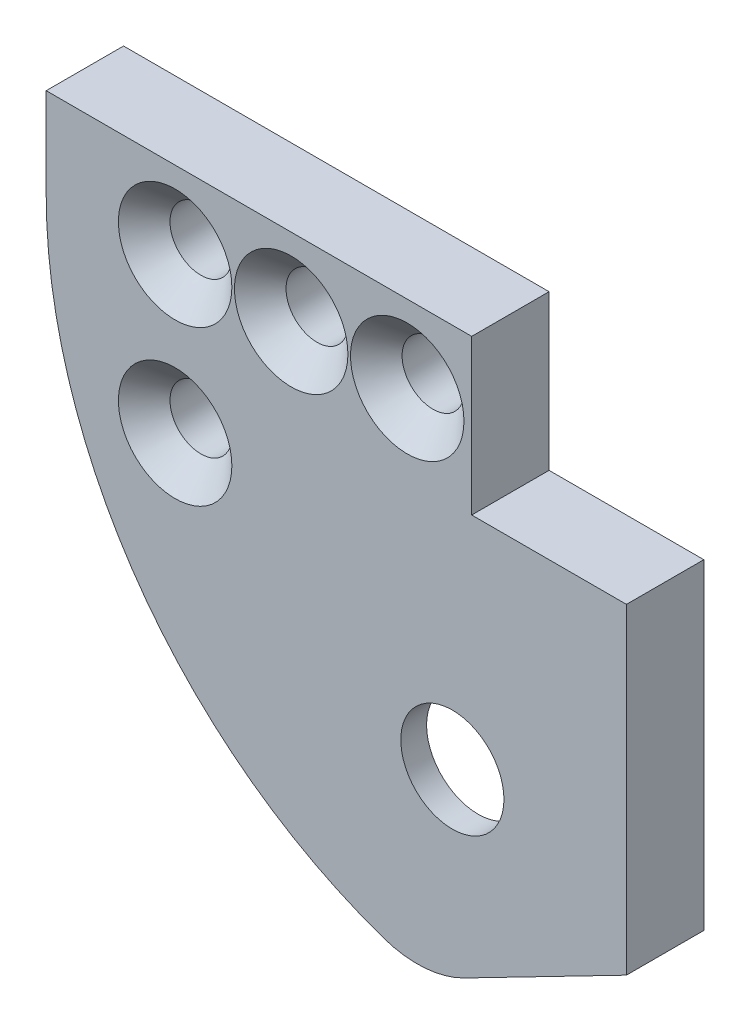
ISO-10303-21;
HEADER;
FILE_DESCRIPTION(('STEP AP214'),'2;1');
FILE_NAME('part.step','',(''),(''),'','','');
FILE_SCHEMA(('AUTOMOTIVE_DESIGN { 1 0 10303 214 1 1 1 1 }'));
ENDSEC;
DATA;
#1=APPLICATION_CONTEXT('core data for automotive mechanical design processes');
#2=APPLICATION_PROTOCOL_DEFINITION('international standard','automotive_design',2000,#1);
#3=PRODUCT_CONTEXT('',#1,'mechanical');
#4=PRODUCT('Part','Part','',(#3));
#5=PRODUCT_RELATED_PRODUCT_CATEGORY('part','',(#4));
#6=PRODUCT_DEFINITION_FORMATION('','',#4);
#7=PRODUCT_DEFINITION_CONTEXT('part definition',#1,'design');
#8=PRODUCT_DEFINITION('design','',#6,#7);
#9=PRODUCT_DEFINITION_SHAPE('','',#8);
#10=(LENGTH_UNIT() NAMED_UNIT(*) SI_UNIT(.MILLI.,.METRE.));
#11=(NAMED_UNIT(*) PLANE_ANGLE_UNIT() SI_UNIT($,.RADIAN.));
#12=(NAMED_UNIT(*) SI_UNIT($,.STERADIAN.) SOLID_ANGLE_UNIT());
#13=UNCERTAINTY_MEASURE_WITH_UNIT(LENGTH_MEASURE(1.E-05),#10,'distance_accuracy_value','');
#14=(GEOMETRIC_REPRESENTATION_CONTEXT(3) GLOBAL_UNCERTAINTY_ASSIGNED_CONTEXT((#13)) GLOBAL_UNIT_ASSIGNED_CONTEXT((#10,
#11,#12)) REPRESENTATION_CONTEXT('',''));
#15=CARTESIAN_POINT('',(0.,0.,0.));
#16=DIRECTION('',(0.,0.,1.));
#17=DIRECTION('',(1.,0.,0.));
#18=AXIS2_PLACEMENT_3D('',#15,#16,#17);
#19=CARTESIAN_POINT('',(31.25,56.0757599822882,10.999));
#20=DIRECTION('',(0.,0.,1.));
#21=DIRECTION('',(1.,0.,0.));
#22=AXIS2_PLACEMENT_3D('',#19,#20,#21);
#23=CYLINDRICAL_SURFACE('',#22,2.);
#24=CARTESIAN_POINT('',(31.25,56.0757599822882,14.));
#25=DIRECTION('',(0.,0.,1.));
#26=DIRECTION('',(1.,0.,0.));
#27=AXIS2_PLACEMENT_3D('',#24,#25,#26);
#28=CIRCLE('',#27,2.);
#29=CARTESIAN_POINT('',(33.25,56.0757599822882,14.));
#30=VERTEX_POINT('',#29);
#31=EDGE_CURVE('E132',#30,#30,#28,.T.);
#32=ORIENTED_EDGE('',*,*,#31,.T.);
#33=EDGE_LOOP('',(#32));
#34=FACE_BOUND('',#33,.T.);
#35=CARTESIAN_POINT('',(31.25,56.0757599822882,13.));
#36=DIRECTION('',(0.,0.,-1.));
#37=DIRECTION('',(-1.,0.,0.));
#38=AXIS2_PLACEMENT_3D('',#35,#36,#37);
#39=CIRCLE('',#38,2.);
#40=CARTESIAN_POINT('',(29.25,56.0757599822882,13.));
#41=VERTEX_POINT('',#40);
#42=EDGE_CURVE('E130',#41,#41,#39,.F.);
#43=ORIENTED_EDGE('',*,*,#42,.F.);
#44=EDGE_LOOP('',(#43));
#45=FACE_BOUND('',#44,.T.);
#46=ADVANCED_FACE('F33',(#34,#45),#23,.F.);
#47=CARTESIAN_POINT('',(15.5,71.,14.));
#48=DIRECTION('',(0.,-1.,0.));
#49=DIRECTION('',(0.,0.,-1.));
#50=AXIS2_PLACEMENT_3D('',#47,#48,#49);
#51=PLANE('',#50);
#52=DIRECTION('',(-1.,0.,0.));
#53=VECTOR('',#52,1.);
#54=CARTESIAN_POINT('',(15.5,71.,11.));
#55=LINE('',#54,#53);
#56=CARTESIAN_POINT('',(32.,71.,11.));
#57=VERTEX_POINT('',#56);
#58=CARTESIAN_POINT('',(15.5,71.,11.));
#59=VERTEX_POINT('',#58);
#60=EDGE_CURVE('E121',#57,#59,#55,.T.);
#61=ORIENTED_EDGE('',*,*,#60,.T.);
#62=DIRECTION('',(0.,0.,-1.));
#63=VECTOR('',#62,1.);
#64=CARTESIAN_POINT('',(15.5,71.,14.));
#65=LINE('',#64,#63);
#66=CARTESIAN_POINT('',(15.5,71.,14.));
#67=VERTEX_POINT('',#66);
#68=EDGE_CURVE('E102',#67,#59,#65,.T.);
#69=ORIENTED_EDGE('',*,*,#68,.F.);
#70=DIRECTION('',(-1.,0.,0.));
#71=VECTOR('',#70,1.);
#72=CARTESIAN_POINT('',(15.5,71.,14.));
#73=LINE('',#72,#71);
#74=CARTESIAN_POINT('',(32.,71.,14.));
#75=VERTEX_POINT('',#74);
#76=EDGE_CURVE('E108',#75,#67,#73,.T.);
#77=ORIENTED_EDGE('',*,*,#76,.F.);
#78=DIRECTION('',(0.,0.,-1.));
#79=VECTOR('',#78,1.);
#80=CARTESIAN_POINT('',(32.,71.,14.));
#81=LINE('',#80,#79);
#82=EDGE_CURVE('E191',#75,#57,#81,.T.);
#83=ORIENTED_EDGE('',*,*,#82,.T.);
#84=EDGE_LOOP('',(#61,#69,#77,#83));
#85=FACE_BOUND('',#84,.T.);
#86=ADVANCED_FACE('F119',(#85),#51,.F.);
#87=CARTESIAN_POINT('',(15.5,67.5,14.));
#88=DIRECTION('',(1.,0.,0.));
#89=DIRECTION('',(0.,0.,-1.));
#90=AXIS2_PLACEMENT_3D('',#87,#88,#89);
#91=PLANE('',#90);
#92=DIRECTION('',(0.,-1.,0.));
#93=VECTOR('',#92,1.);
#94=CARTESIAN_POINT('',(15.5,67.5,11.));
#95=LINE('',#94,#93);
#96=CARTESIAN_POINT('',(15.5,67.5,11.));
#97=VERTEX_POINT('',#96);
#98=EDGE_CURVE('E193',#59,#97,#95,.T.);
#99=ORIENTED_EDGE('',*,*,#98,.T.);
#100=DIRECTION('',(0.,0.,-1.));
#101=VECTOR('',#100,1.);
#102=CARTESIAN_POINT('',(15.5,67.5,14.));
#103=LINE('',#102,#101);
#104=CARTESIAN_POINT('',(15.5,67.5,14.));
#105=VERTEX_POINT('',#104);
#106=EDGE_CURVE('E105',#105,#97,#103,.T.);
#107=ORIENTED_EDGE('',*,*,#106,.F.);
#108=DIRECTION('',(0.,-1.,0.));
#109=VECTOR('',#108,1.);
#110=CARTESIAN_POINT('',(15.5,67.5,14.));
#111=LINE('',#110,#109);
#112=EDGE_CURVE('E98',#67,#105,#111,.T.);
#113=ORIENTED_EDGE('',*,*,#112,.F.);
#114=ORIENTED_EDGE('',*,*,#68,.T.);
#115=EDGE_LOOP('',(#99,#107,#113,#114));
#116=FACE_BOUND('',#115,.T.);
#117=ADVANCED_FACE('F100',(#116),#91,.F.);
#118=CARTESIAN_POINT('',(35.,67.5,14.));
#119=DIRECTION('',(0.,0.,-1.));
#120=DIRECTION('',(-1.,0.,0.));
#121=AXIS2_PLACEMENT_3D('',#118,#119,#120);
#122=CYLINDRICAL_SURFACE('',#121,19.5);
#123=CARTESIAN_POINT('',(35.,67.5,11.));
#124=DIRECTION('',(0.,0.,1.));
#125=DIRECTION('',(1.,0.,0.));
#126=AXIS2_PLACEMENT_3D('',#123,#124,#125);
#127=CIRCLE('',#126,19.5);
#128=CARTESIAN_POINT('',(28.56738090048,49.0915396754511,11.));
#129=VERTEX_POINT('',#128);
#130=EDGE_CURVE('E195',#97,#129,#127,.T.);
#131=ORIENTED_EDGE('',*,*,#130,.T.);
#132=DIRECTION('',(0.,0.,-1.));
#133=VECTOR('',#132,1.);
#134=CARTESIAN_POINT('',(28.56738090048,49.0915396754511,14.));
#135=LINE('',#134,#133);
#136=CARTESIAN_POINT('',(28.56738090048,49.0915396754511,14.));
#137=VERTEX_POINT('',#136);
#138=EDGE_CURVE('E41',#129,#137,#135,.F.);
#139=ORIENTED_EDGE('',*,*,#138,.T.);
#140=CARTESIAN_POINT('',(35.,67.5,14.));
#141=DIRECTION('',(0.,0.,1.));
#142=DIRECTION('',(1.,0.,0.));
#143=AXIS2_PLACEMENT_3D('',#140,#141,#142);
#144=CIRCLE('',#143,19.5);
#145=EDGE_CURVE('E107',#105,#137,#144,.T.);
#146=ORIENTED_EDGE('',*,*,#145,.F.);
#147=ORIENTED_EDGE('',*,*,#106,.T.);
#148=EDGE_LOOP('',(#131,#139,#146,#147));
#149=FACE_BOUND('',#148,.T.);
#150=ADVANCED_FACE('F228',(#149),#122,.T.);
#151=CARTESIAN_POINT('',(38.,52.5477504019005,14.));
#152=DIRECTION('',(-0.45797929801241,0.888962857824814,0.));
#153=DIRECTION('',(-0.888962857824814,-0.45797929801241,0.));
#154=AXIS2_PLACEMENT_3D('',#151,#152,#153);
#155=PLANE('',#154);
#156=DIRECTION('',(0.888962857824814,0.45797929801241,0.));
#157=VECTOR('',#156,1.);
#158=CARTESIAN_POINT('',(38.,52.5477504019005,14.));
#159=LINE('',#158,#157);
#160=CARTESIAN_POINT('',(31.7188097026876,49.3117826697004,14.));
#161=VERTEX_POINT('',#160);
#162=CARTESIAN_POINT('',(38.,52.5477504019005,14.));
#163=VERTEX_POINT('',#162);
#164=EDGE_CURVE('E184',#161,#163,#159,.T.);
#165=ORIENTED_EDGE('',*,*,#164,.F.);
#166=DIRECTION('',(0.,0.,-1.));
#167=VECTOR('',#166,1.);
#168=CARTESIAN_POINT('',(31.7188097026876,49.3117826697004,14.));
#169=LINE('',#168,#167);
#170=CARTESIAN_POINT('',(31.7188097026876,49.3117826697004,11.));
#171=VERTEX_POINT('',#170);
#172=EDGE_CURVE('E122',#161,#171,#169,.T.);
#173=ORIENTED_EDGE('',*,*,#172,.T.);
#174=DIRECTION('',(0.888962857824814,0.45797929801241,0.));
#175=VECTOR('',#174,1.);
#176=CARTESIAN_POINT('',(38.,52.5477504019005,11.));
#177=LINE('',#176,#175);
#178=CARTESIAN_POINT('',(38.,52.5477504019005,11.));
#179=VERTEX_POINT('',#178);
#180=EDGE_CURVE('E197',#171,#179,#177,.T.);
#181=ORIENTED_EDGE('',*,*,#180,.T.);
#182=DIRECTION('',(0.,0.,-1.));
#183=VECTOR('',#182,1.);
#184=CARTESIAN_POINT('',(38.,52.5477504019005,14.));
#185=LINE('',#184,#183);
#186=EDGE_CURVE('E126',#163,#179,#185,.T.);
#187=ORIENTED_EDGE('',*,*,#186,.F.);
#188=EDGE_LOOP('',(#165,#173,#181,#187));
#189=FACE_BOUND('',#188,.T.);
#190=ADVANCED_FACE('F232',(#189),#155,.F.);
#191=CARTESIAN_POINT('',(38.,65.,14.));
#192=DIRECTION('',(-1.,0.,0.));
#193=DIRECTION('',(0.,-1.,0.));
#194=AXIS2_PLACEMENT_3D('',#191,#192,#193);
#195=PLANE('',#194);
#196=DIRECTION('',(0.,1.,0.));
#197=VECTOR('',#196,1.);
#198=CARTESIAN_POINT('',(38.,65.,11.));
#199=LINE('',#198,#197);
#200=CARTESIAN_POINT('',(38.,65.,11.));
#201=VERTEX_POINT('',#200);
#202=EDGE_CURVE('E199',#179,#201,#199,.T.);
#203=ORIENTED_EDGE('',*,*,#202,.T.);
#204=DIRECTION('',(0.,0.,-1.));
#205=VECTOR('',#204,1.);
#206=CARTESIAN_POINT('',(38.,65.,14.));
#207=LINE('',#206,#205);
#208=CARTESIAN_POINT('',(38.,65.,14.));
#209=VERTEX_POINT('',#208);
#210=EDGE_CURVE('E208',#209,#201,#207,.T.);
#211=ORIENTED_EDGE('',*,*,#210,.F.);
#212=DIRECTION('',(0.,1.,0.));
#213=VECTOR('',#212,1.);
#214=CARTESIAN_POINT('',(38.,65.,14.));
#215=LINE('',#214,#213);
#216=EDGE_CURVE('E186',#163,#209,#215,.T.);
#217=ORIENTED_EDGE('',*,*,#216,.F.);
#218=ORIENTED_EDGE('',*,*,#186,.T.);
#219=EDGE_LOOP('',(#203,#211,#217,#218));
#220=FACE_BOUND('',#219,.T.);
#221=ADVANCED_FACE('F215',(#220),#195,.F.);
#222=CARTESIAN_POINT('',(32.,65.,14.));
#223=DIRECTION('',(0.,-1.,0.));
#224=DIRECTION('',(0.,0.,-1.));
#225=AXIS2_PLACEMENT_3D('',#222,#223,#224);
#226=PLANE('',#225);
#227=DIRECTION('',(-1.,0.,0.));
#228=VECTOR('',#227,1.);
#229=CARTESIAN_POINT('',(32.,65.,11.));
#230=LINE('',#229,#228);
#231=CARTESIAN_POINT('',(32.,65.,11.));
#232=VERTEX_POINT('',#231);
#233=EDGE_CURVE('E201',#201,#232,#230,.T.);
#234=ORIENTED_EDGE('',*,*,#233,.T.);
#235=DIRECTION('',(0.,0.,-1.));
#236=VECTOR('',#235,1.);
#237=CARTESIAN_POINT('',(32.,65.,14.));
#238=LINE('',#237,#236);
#239=CARTESIAN_POINT('',(32.,65.,14.));
#240=VERTEX_POINT('',#239);
#241=EDGE_CURVE('E205',#240,#232,#238,.T.);
#242=ORIENTED_EDGE('',*,*,#241,.F.);
#243=DIRECTION('',(-1.,0.,0.));
#244=VECTOR('',#243,1.);
#245=CARTESIAN_POINT('',(32.,65.,14.));
#246=LINE('',#245,#244);
#247=EDGE_CURVE('E188',#209,#240,#246,.T.);
#248=ORIENTED_EDGE('',*,*,#247,.F.);
#249=ORIENTED_EDGE('',*,*,#210,.T.);
#250=EDGE_LOOP('',(#234,#242,#248,#249));
#251=FACE_BOUND('',#250,.T.);
#252=ADVANCED_FACE('F224',(#251),#226,.F.);
#253=CARTESIAN_POINT('',(32.,71.,14.));
#254=DIRECTION('',(-1.,0.,0.));
#255=DIRECTION('',(0.,0.,1.));
#256=AXIS2_PLACEMENT_3D('',#253,#254,#255);
#257=PLANE('',#256);
#258=DIRECTION('',(0.,1.,0.));
#259=VECTOR('',#258,1.);
#260=CARTESIAN_POINT('',(32.,71.,11.));
#261=LINE('',#260,#259);
#262=EDGE_CURVE('E117',#232,#57,#261,.T.);
#263=ORIENTED_EDGE('',*,*,#262,.T.);
#264=ORIENTED_EDGE('',*,*,#82,.F.);
#265=DIRECTION('',(0.,1.,0.));
#266=VECTOR('',#265,1.);
#267=CARTESIAN_POINT('',(32.,71.,14.));
#268=LINE('',#267,#266);
#269=EDGE_CURVE('E113',#240,#75,#268,.T.);
#270=ORIENTED_EDGE('',*,*,#269,.F.);
#271=ORIENTED_EDGE('',*,*,#241,.T.);
#272=EDGE_LOOP('',(#263,#264,#270,#271));
#273=FACE_BOUND('',#272,.T.);
#274=ADVANCED_FACE('F227',(#273),#257,.F.);
#275=CARTESIAN_POINT('',(35.,67.5,14.));
#276=DIRECTION('',(0.,0.,1.));
#277=DIRECTION('',(1.,0.,0.));
#278=AXIS2_PLACEMENT_3D('',#275,#276,#277);
#279=PLANE('',#278);
#280=ORIENTED_EDGE('',*,*,#31,.F.);
#281=EDGE_LOOP('',(#280));
#282=FACE_BOUND('',#281,.T.);
#283=CARTESIAN_POINT('',(20.5,62.,14.));
#284=DIRECTION('',(0.,0.,1.));
#285=DIRECTION('',(1.,0.,0.));
#286=AXIS2_PLACEMENT_3D('',#283,#284,#285);
#287=CIRCLE('',#286,2.2);
#288=CARTESIAN_POINT('',(22.7,62.,14.));
#289=VERTEX_POINT('',#288);
#290=EDGE_CURVE('E138',#289,#289,#287,.T.);
#291=ORIENTED_EDGE('',*,*,#290,.F.);
#292=EDGE_LOOP('',(#291));
#293=FACE_BOUND('',#292,.T.);
#294=CARTESIAN_POINT('',(29.5,68.,14.));
#295=DIRECTION('',(0.,0.,1.));
#296=DIRECTION('',(1.,0.,0.));
#297=AXIS2_PLACEMENT_3D('',#294,#295,#296);
#298=CIRCLE('',#297,2.2);
#299=CARTESIAN_POINT('',(31.7,68.,14.));
#300=VERTEX_POINT('',#299);
#301=EDGE_CURVE('E156',#300,#300,#298,.T.);
#302=ORIENTED_EDGE('',*,*,#301,.F.);
#303=EDGE_LOOP('',(#302));
#304=FACE_BOUND('',#303,.T.);
#305=CARTESIAN_POINT('',(25.,68.,14.));
#306=DIRECTION('',(0.,0.,1.));
#307=DIRECTION('',(1.,0.,0.));
#308=AXIS2_PLACEMENT_3D('',#305,#306,#307);
#309=CIRCLE('',#308,2.2);
#310=CARTESIAN_POINT('',(27.2,68.,14.));
#311=VERTEX_POINT('',#310);
#312=EDGE_CURVE('E165',#311,#311,#309,.T.);
#313=ORIENTED_EDGE('',*,*,#312,.F.);
#314=EDGE_LOOP('',(#313));
#315=FACE_BOUND('',#314,.T.);
#316=CARTESIAN_POINT('',(20.5,68.,14.));
#317=DIRECTION('',(0.,0.,1.));
#318=DIRECTION('',(1.,0.,0.));
#319=AXIS2_PLACEMENT_3D('',#316,#317,#318);
#320=CIRCLE('',#319,2.2);
#321=CARTESIAN_POINT('',(22.7,68.,14.));
#322=VERTEX_POINT('',#321);
#323=EDGE_CURVE('E174',#322,#322,#320,.T.);
#324=ORIENTED_EDGE('',*,*,#323,.F.);
#325=EDGE_LOOP('',(#324));
#326=FACE_BOUND('',#325,.T.);
#327=ORIENTED_EDGE('',*,*,#145,.T.);
#328=CARTESIAN_POINT('',(29.8868925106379,52.8676341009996,14.));
#329=DIRECTION('',(0.,0.,1.));
#330=DIRECTION('',(1.,0.,0.));
#331=AXIS2_PLACEMENT_3D('',#328,#329,#330);
#332=CIRCLE('',#331,4.);
#333=EDGE_CURVE('E11',#137,#161,#332,.T.);
#334=ORIENTED_EDGE('',*,*,#333,.T.);
#335=ORIENTED_EDGE('',*,*,#164,.T.);
#336=ORIENTED_EDGE('',*,*,#216,.T.);
#337=ORIENTED_EDGE('',*,*,#247,.T.);
#338=ORIENTED_EDGE('',*,*,#269,.T.);
#339=ORIENTED_EDGE('',*,*,#76,.T.);
#340=ORIENTED_EDGE('',*,*,#112,.T.);
#341=EDGE_LOOP('',(#327,#334,#335,#336,#337,#338,#339,#340));
#342=FACE_BOUND('',#341,.T.);
#343=ADVANCED_FACE('F111',(#282,#293,#304,#315,#326,#342),#279,.T.);
#344=CARTESIAN_POINT('',(35.,67.5,11.));
#345=DIRECTION('',(0.,0.,1.));
#346=DIRECTION('',(1.,0.,0.));
#347=AXIS2_PLACEMENT_3D('',#344,#345,#346);
#348=PLANE('',#347);
#349=CARTESIAN_POINT('',(31.25,56.0757599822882,11.));
#350=DIRECTION('',(0.,0.,-1.));
#351=DIRECTION('',(-1.,0.,0.));
#352=AXIS2_PLACEMENT_3D('',#349,#350,#351);
#353=CIRCLE('',#352,5.5);
#354=CARTESIAN_POINT('',(25.75,56.0757599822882,11.));
#355=VERTEX_POINT('',#354);
#356=EDGE_CURVE('E141',#355,#355,#353,.T.);
#357=ORIENTED_EDGE('',*,*,#356,.F.);
#358=EDGE_LOOP('',(#357));
#359=FACE_BOUND('',#358,.T.);
#360=CARTESIAN_POINT('',(20.5,62.,11.));
#361=DIRECTION('',(0.,0.,1.));
#362=DIRECTION('',(1.,0.,0.));
#363=AXIS2_PLACEMENT_3D('',#360,#361,#362);
#364=CIRCLE('',#363,1.2);
#365=CARTESIAN_POINT('',(21.7,62.,11.));
#366=VERTEX_POINT('',#365);
#367=EDGE_CURVE('E153',#366,#366,#364,.T.);
#368=ORIENTED_EDGE('',*,*,#367,.T.);
#369=EDGE_LOOP('',(#368));
#370=FACE_BOUND('',#369,.T.);
#371=CARTESIAN_POINT('',(29.5,68.,11.));
#372=DIRECTION('',(0.,0.,1.));
#373=DIRECTION('',(1.,0.,0.));
#374=AXIS2_PLACEMENT_3D('',#371,#372,#373);
#375=CIRCLE('',#374,1.2);
#376=CARTESIAN_POINT('',(30.7,68.,11.));
#377=VERTEX_POINT('',#376);
#378=EDGE_CURVE('E162',#377,#377,#375,.T.);
#379=ORIENTED_EDGE('',*,*,#378,.T.);
#380=EDGE_LOOP('',(#379));
#381=FACE_BOUND('',#380,.T.);
#382=CARTESIAN_POINT('',(25.,68.,11.));
#383=DIRECTION('',(0.,0.,1.));
#384=DIRECTION('',(1.,0.,0.));
#385=AXIS2_PLACEMENT_3D('',#382,#383,#384);
#386=CIRCLE('',#385,1.2);
#387=CARTESIAN_POINT('',(26.2,68.,11.));
#388=VERTEX_POINT('',#387);
#389=EDGE_CURVE('E171',#388,#388,#386,.T.);
#390=ORIENTED_EDGE('',*,*,#389,.T.);
#391=EDGE_LOOP('',(#390));
#392=FACE_BOUND('',#391,.T.);
#393=CARTESIAN_POINT('',(20.5,68.,11.));
#394=DIRECTION('',(0.,0.,1.));
#395=DIRECTION('',(1.,0.,0.));
#396=AXIS2_PLACEMENT_3D('',#393,#394,#395);
#397=CIRCLE('',#396,1.2);
#398=CARTESIAN_POINT('',(21.7,68.,11.));
#399=VERTEX_POINT('',#398);
#400=EDGE_CURVE('E180',#399,#399,#397,.T.);
#401=ORIENTED_EDGE('',*,*,#400,.T.);
#402=EDGE_LOOP('',(#401));
#403=FACE_BOUND('',#402,.T.);
#404=ORIENTED_EDGE('',*,*,#180,.F.);
#405=CARTESIAN_POINT('',(29.8868925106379,52.8676341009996,11.));
#406=DIRECTION('',(0.,0.,1.));
#407=DIRECTION('',(1.,0.,0.));
#408=AXIS2_PLACEMENT_3D('',#405,#406,#407);
#409=CIRCLE('',#408,4.);
#410=EDGE_CURVE('E55',#171,#129,#409,.F.);
#411=ORIENTED_EDGE('',*,*,#410,.T.);
#412=ORIENTED_EDGE('',*,*,#130,.F.);
#413=ORIENTED_EDGE('',*,*,#98,.F.);
#414=ORIENTED_EDGE('',*,*,#60,.F.);
#415=ORIENTED_EDGE('',*,*,#262,.F.);
#416=ORIENTED_EDGE('',*,*,#233,.F.);
#417=ORIENTED_EDGE('',*,*,#202,.F.);
#418=EDGE_LOOP('',(#404,#411,#412,#413,#414,#415,#416,#417));
#419=FACE_BOUND('',#418,.T.);
#420=ADVANCED_FACE('F220',(#359,#370,#381,#392,#403,#419),#348,.F.);
#421=CARTESIAN_POINT('',(20.5,68.,14.));
#422=DIRECTION('',(0.,0.,1.));
#423=DIRECTION('',(1.,0.,0.));
#424=AXIS2_PLACEMENT_3D('',#421,#422,#423);
#425=CYLINDRICAL_SURFACE('',#424,1.2);
#426=ORIENTED_EDGE('',*,*,#400,.F.);
#427=EDGE_LOOP('',(#426));
#428=FACE_BOUND('',#427,.T.);
#429=CARTESIAN_POINT('',(20.5,68.,13.));
#430=DIRECTION('',(0.,0.,1.));
#431=DIRECTION('',(1.,0.,0.));
#432=AXIS2_PLACEMENT_3D('',#429,#430,#431);
#433=CIRCLE('',#432,1.2);
#434=CARTESIAN_POINT('',(21.7,68.,13.));
#435=VERTEX_POINT('',#434);
#436=EDGE_CURVE('E177',#435,#435,#433,.T.);
#437=ORIENTED_EDGE('',*,*,#436,.T.);
#438=EDGE_LOOP('',(#437));
#439=FACE_BOUND('',#438,.T.);
#440=ADVANCED_FACE('F280',(#428,#439),#425,.F.);
#441=CARTESIAN_POINT('',(20.5,68.,14.));
#442=DIRECTION('',(0.,0.,1.));
#443=DIRECTION('',(1.,0.,0.));
#444=AXIS2_PLACEMENT_3D('',#441,#442,#443);
#445=CONICAL_SURFACE('',#444,2.2,0.785398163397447);
#446=ORIENTED_EDGE('',*,*,#436,.F.);
#447=EDGE_LOOP('',(#446));
#448=FACE_BOUND('',#447,.T.);
#449=ORIENTED_EDGE('',*,*,#323,.T.);
#450=EDGE_LOOP('',(#449));
#451=FACE_BOUND('',#450,.T.);
#452=ADVANCED_FACE('F276',(#448,#451),#445,.F.);
#453=CARTESIAN_POINT('',(25.,68.,14.));
#454=DIRECTION('',(0.,0.,1.));
#455=DIRECTION('',(1.,0.,0.));
#456=AXIS2_PLACEMENT_3D('',#453,#454,#455);
#457=CYLINDRICAL_SURFACE('',#456,1.2);
#458=ORIENTED_EDGE('',*,*,#389,.F.);
#459=EDGE_LOOP('',(#458));
#460=FACE_BOUND('',#459,.T.);
#461=CARTESIAN_POINT('',(25.,68.,13.));
#462=DIRECTION('',(0.,0.,1.));
#463=DIRECTION('',(1.,0.,0.));
#464=AXIS2_PLACEMENT_3D('',#461,#462,#463);
#465=CIRCLE('',#464,1.2);
#466=CARTESIAN_POINT('',(26.2,68.,13.));
#467=VERTEX_POINT('',#466);
#468=EDGE_CURVE('E168',#467,#467,#465,.T.);
#469=ORIENTED_EDGE('',*,*,#468,.T.);
#470=EDGE_LOOP('',(#469));
#471=FACE_BOUND('',#470,.T.);
#472=ADVANCED_FACE('F272',(#460,#471),#457,.F.);
#473=CARTESIAN_POINT('',(25.,68.,14.));
#474=DIRECTION('',(0.,0.,1.));
#475=DIRECTION('',(1.,0.,0.));
#476=AXIS2_PLACEMENT_3D('',#473,#474,#475);
#477=CONICAL_SURFACE('',#476,2.2,0.785398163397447);
#478=ORIENTED_EDGE('',*,*,#468,.F.);
#479=EDGE_LOOP('',(#478));
#480=FACE_BOUND('',#479,.T.);
#481=ORIENTED_EDGE('',*,*,#312,.T.);
#482=EDGE_LOOP('',(#481));
#483=FACE_BOUND('',#482,.T.);
#484=ADVANCED_FACE('F268',(#480,#483),#477,.F.);
#485=CARTESIAN_POINT('',(29.5,68.,14.));
#486=DIRECTION('',(0.,0.,1.));
#487=DIRECTION('',(1.,0.,0.));
#488=AXIS2_PLACEMENT_3D('',#485,#486,#487);
#489=CYLINDRICAL_SURFACE('',#488,1.2);
#490=ORIENTED_EDGE('',*,*,#378,.F.);
#491=EDGE_LOOP('',(#490));
#492=FACE_BOUND('',#491,.T.);
#493=CARTESIAN_POINT('',(29.5,68.,13.));
#494=DIRECTION('',(0.,0.,1.));
#495=DIRECTION('',(1.,0.,0.));
#496=AXIS2_PLACEMENT_3D('',#493,#494,#495);
#497=CIRCLE('',#496,1.2);
#498=CARTESIAN_POINT('',(30.7,68.,13.));
#499=VERTEX_POINT('',#498);
#500=EDGE_CURVE('E159',#499,#499,#497,.T.);
#501=ORIENTED_EDGE('',*,*,#500,.T.);
#502=EDGE_LOOP('',(#501));
#503=FACE_BOUND('',#502,.T.);
#504=ADVANCED_FACE('F264',(#492,#503),#489,.F.);
#505=CARTESIAN_POINT('',(29.5,68.,14.));
#506=DIRECTION('',(0.,0.,1.));
#507=DIRECTION('',(1.,0.,0.));
#508=AXIS2_PLACEMENT_3D('',#505,#506,#507);
#509=CONICAL_SURFACE('',#508,2.2,0.785398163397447);
#510=ORIENTED_EDGE('',*,*,#500,.F.);
#511=EDGE_LOOP('',(#510));
#512=FACE_BOUND('',#511,.T.);
#513=ORIENTED_EDGE('',*,*,#301,.T.);
#514=EDGE_LOOP('',(#513));
#515=FACE_BOUND('',#514,.T.);
#516=ADVANCED_FACE('F260',(#512,#515),#509,.F.);
#517=CARTESIAN_POINT('',(20.5,62.,14.));
#518=DIRECTION('',(0.,0.,1.));
#519=DIRECTION('',(1.,0.,0.));
#520=AXIS2_PLACEMENT_3D('',#517,#518,#519);
#521=CYLINDRICAL_SURFACE('',#520,1.2);
#522=ORIENTED_EDGE('',*,*,#367,.F.);
#523=EDGE_LOOP('',(#522));
#524=FACE_BOUND('',#523,.T.);
#525=CARTESIAN_POINT('',(20.5,62.,13.));
#526=DIRECTION('',(0.,0.,1.));
#527=DIRECTION('',(1.,0.,0.));
#528=AXIS2_PLACEMENT_3D('',#525,#526,#527);
#529=CIRCLE('',#528,1.2);
#530=CARTESIAN_POINT('',(21.7,62.,13.));
#531=VERTEX_POINT('',#530);
#532=EDGE_CURVE('E150',#531,#531,#529,.T.);
#533=ORIENTED_EDGE('',*,*,#532,.T.);
#534=EDGE_LOOP('',(#533));
#535=FACE_BOUND('',#534,.T.);
#536=ADVANCED_FACE('F256',(#524,#535),#521,.F.);
#537=CARTESIAN_POINT('',(20.5,62.,14.));
#538=DIRECTION('',(0.,0.,1.));
#539=DIRECTION('',(1.,0.,0.));
#540=AXIS2_PLACEMENT_3D('',#537,#538,#539);
#541=CONICAL_SURFACE('',#540,2.2,0.785398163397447);
#542=ORIENTED_EDGE('',*,*,#532,.F.);
#543=EDGE_LOOP('',(#542));
#544=FACE_BOUND('',#543,.T.);
#545=ORIENTED_EDGE('',*,*,#290,.T.);
#546=EDGE_LOOP('',(#545));
#547=FACE_BOUND('',#546,.T.);
#548=ADVANCED_FACE('F252',(#544,#547),#541,.F.);
#549=CARTESIAN_POINT('',(31.25,56.0757599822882,13.));
#550=DIRECTION('',(0.,0.,-1.));
#551=DIRECTION('',(-1.,0.,0.));
#552=AXIS2_PLACEMENT_3D('',#549,#550,#551);
#553=PLANE('',#552);
#554=CARTESIAN_POINT('',(31.25,56.0757599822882,13.));
#555=DIRECTION('',(0.,0.,-1.));
#556=DIRECTION('',(-1.,0.,0.));
#557=AXIS2_PLACEMENT_3D('',#554,#555,#556);
#558=CIRCLE('',#557,5.5);
#559=CARTESIAN_POINT('',(25.75,56.0757599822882,13.));
#560=VERTEX_POINT('',#559);
#561=EDGE_CURVE('E133',#560,#560,#558,.T.);
#562=ORIENTED_EDGE('',*,*,#561,.T.);
#563=EDGE_LOOP('',(#562));
#564=FACE_BOUND('',#563,.T.);
#565=ORIENTED_EDGE('',*,*,#42,.T.);
#566=EDGE_LOOP('',(#565));
#567=FACE_BOUND('',#566,.T.);
#568=ADVANCED_FACE('F255',(#564,#567),#553,.T.);
#569=CARTESIAN_POINT('',(31.25,56.0757599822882,13.));
#570=DIRECTION('',(0.,0.,-1.));
#571=DIRECTION('',(-1.,0.,0.));
#572=AXIS2_PLACEMENT_3D('',#569,#570,#571);
#573=CYLINDRICAL_SURFACE('',#572,5.5);
#574=ORIENTED_EDGE('',*,*,#561,.F.);
#575=EDGE_LOOP('',(#574));
#576=FACE_BOUND('',#575,.T.);
#577=ORIENTED_EDGE('',*,*,#356,.T.);
#578=EDGE_LOOP('',(#577));
#579=FACE_BOUND('',#578,.T.);
#580=ADVANCED_FACE('F250',(#576,#579),#573,.F.);
#581=CARTESIAN_POINT('',(29.8868925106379,52.8676341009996,14.));
#582=DIRECTION('',(0.,0.,-1.));
#583=DIRECTION('',(-1.,0.,0.));
#584=AXIS2_PLACEMENT_3D('',#581,#582,#583);
#585=CYLINDRICAL_SURFACE('',#584,4.);
#586=ORIENTED_EDGE('',*,*,#333,.F.);
#587=ORIENTED_EDGE('',*,*,#138,.F.);
#588=ORIENTED_EDGE('',*,*,#410,.F.);
#589=ORIENTED_EDGE('',*,*,#172,.F.);
#590=EDGE_LOOP('',(#586,#587,#588,#589));
#591=FACE_BOUND('',#590,.T.);
#592=ADVANCED_FACE('F35',(#591),#585,.T.);
#593=CLOSED_SHELL('',(#46,#86,#117,#150,#190,#221,#252,#274,#343,#420,#440,#452,#472,#484,#504,
#516,#536,#548,#568,#580,#592));
#594=MANIFOLD_SOLID_BREP('B2',#593);
#595=ADVANCED_BREP_SHAPE_REPRESENTATION('',(#18,#594),#14);
#596=SHAPE_DEFINITION_REPRESENTATION(#9,#595);
ENDSEC;
END-ISO-10303-21;
